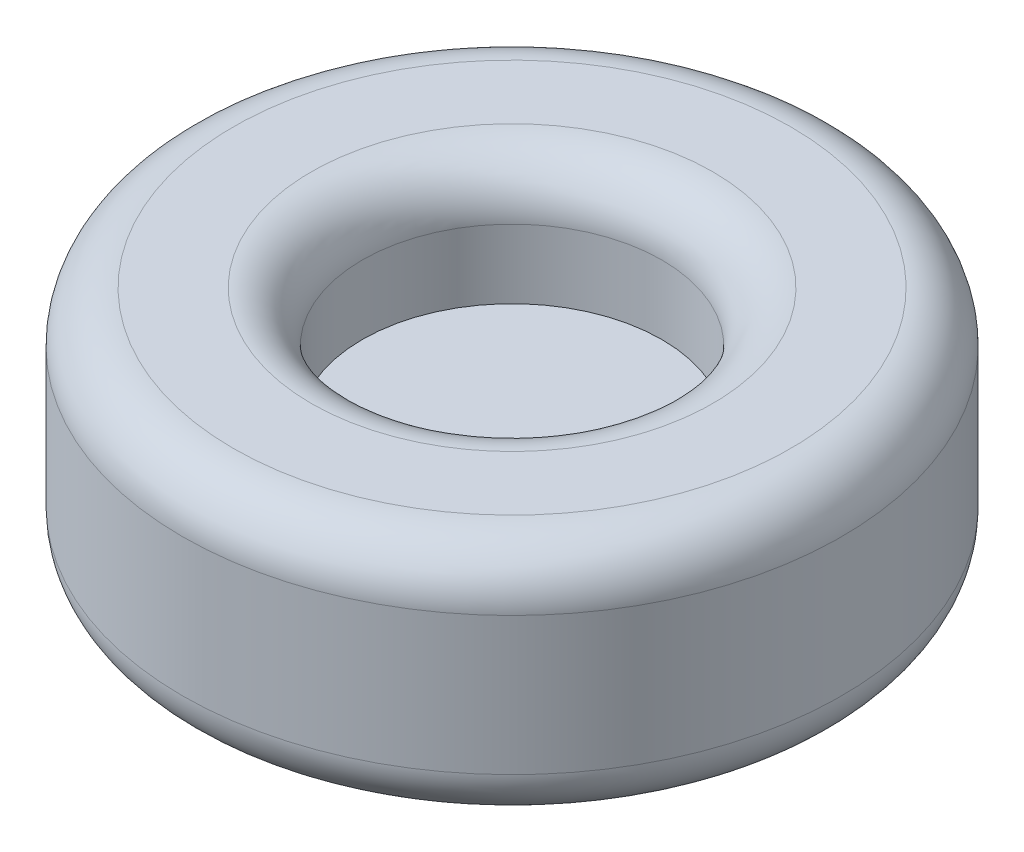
ISO-10303-21;
HEADER;
FILE_DESCRIPTION(('STEP AP214'),'2;1');
FILE_NAME('part.step','',(''),(''),'','','');
FILE_SCHEMA(('AUTOMOTIVE_DESIGN { 1 0 10303 214 1 1 1 1 }'));
ENDSEC;
DATA;
#1=APPLICATION_CONTEXT('core data for automotive mechanical design processes');
#2=APPLICATION_PROTOCOL_DEFINITION('international standard','automotive_design',2000,#1);
#3=PRODUCT_CONTEXT('',#1,'mechanical');
#4=PRODUCT('Part','Part','',(#3));
#5=PRODUCT_RELATED_PRODUCT_CATEGORY('part','',(#4));
#6=PRODUCT_DEFINITION_FORMATION('','',#4);
#7=PRODUCT_DEFINITION_CONTEXT('part definition',#1,'design');
#8=PRODUCT_DEFINITION('design','',#6,#7);
#9=PRODUCT_DEFINITION_SHAPE('','',#8);
#10=(LENGTH_UNIT() NAMED_UNIT(*) SI_UNIT(.MILLI.,.METRE.));
#11=(NAMED_UNIT(*) PLANE_ANGLE_UNIT() SI_UNIT($,.RADIAN.));
#12=(NAMED_UNIT(*) SI_UNIT($,.STERADIAN.) SOLID_ANGLE_UNIT());
#13=UNCERTAINTY_MEASURE_WITH_UNIT(LENGTH_MEASURE(1.E-05),#10,'distance_accuracy_value','');
#14=(GEOMETRIC_REPRESENTATION_CONTEXT(3) GLOBAL_UNCERTAINTY_ASSIGNED_CONTEXT((#13)) GLOBAL_UNIT_ASSIGNED_CONTEXT((#10,
#11,#12)) REPRESENTATION_CONTEXT('',''));
#15=CARTESIAN_POINT('',(0.,0.,0.));
#16=DIRECTION('',(0.,0.,1.));
#17=DIRECTION('',(1.,0.,0.));
#18=AXIS2_PLACEMENT_3D('',#15,#16,#17);
#19=CARTESIAN_POINT('',(0.,-88.9,0.));
#20=DIRECTION('',(0.,1.,0.));
#21=DIRECTION('',(0.,0.,1.));
#22=AXIS2_PLACEMENT_3D('',#19,#20,#21);
#23=CYLINDRICAL_SURFACE('',#22,279.4);
#24=CARTESIAN_POINT('',(0.,-45.72,0.));
#25=DIRECTION('',(0.,1.,0.));
#26=DIRECTION('',(0.,0.,1.));
#27=AXIS2_PLACEMENT_3D('',#24,#25,#26);
#28=CIRCLE('',#27,279.4);
#29=CARTESIAN_POINT('',(0.,-45.72,279.4));
#30=VERTEX_POINT('',#29);
#31=EDGE_CURVE('E51',#30,#30,#28,.T.);
#32=ORIENTED_EDGE('',*,*,#31,.T.);
#33=EDGE_LOOP('',(#32));
#34=FACE_BOUND('',#33,.T.);
#35=CARTESIAN_POINT('',(0.,71.12,0.));
#36=DIRECTION('',(0.,1.,0.));
#37=DIRECTION('',(0.,0.,1.));
#38=AXIS2_PLACEMENT_3D('',#35,#36,#37);
#39=CIRCLE('',#38,279.4);
#40=CARTESIAN_POINT('',(0.,71.12,279.4));
#41=VERTEX_POINT('',#40);
#42=EDGE_CURVE('E54',#41,#41,#39,.F.);
#43=ORIENTED_EDGE('',*,*,#42,.T.);
#44=EDGE_LOOP('',(#43));
#45=FACE_BOUND('',#44,.T.);
#46=ADVANCED_FACE('F31',(#34,#45),#23,.T.);
#47=CARTESIAN_POINT('',(0.,-88.9,0.));
#48=DIRECTION('',(0.,1.,0.));
#49=DIRECTION('',(0.,0.,1.));
#50=AXIS2_PLACEMENT_3D('',#47,#48,#49);
#51=PLANE('',#50);
#52=CARTESIAN_POINT('',(0.,-88.9,0.));
#53=DIRECTION('',(0.,1.,0.));
#54=DIRECTION('',(0.,0.,1.));
#55=AXIS2_PLACEMENT_3D('',#52,#53,#54);
#56=CIRCLE('',#55,236.22);
#57=CARTESIAN_POINT('',(0.,-88.9,236.22));
#58=VERTEX_POINT('',#57);
#59=EDGE_CURVE('E46',#58,#58,#56,.F.);
#60=ORIENTED_EDGE('',*,*,#59,.T.);
#61=EDGE_LOOP('',(#60));
#62=FACE_BOUND('',#61,.T.);
#63=ADVANCED_FACE('F76',(#62),#51,.F.);
#64=CARTESIAN_POINT('',(0.,114.3,0.));
#65=DIRECTION('',(0.,1.,0.));
#66=DIRECTION('',(0.,0.,1.));
#67=AXIS2_PLACEMENT_3D('',#64,#65,#66);
#68=PLANE('',#67);
#69=CARTESIAN_POINT('',(0.,114.3,0.));
#70=DIRECTION('',(0.,1.,0.));
#71=DIRECTION('',(0.,0.,1.));
#72=AXIS2_PLACEMENT_3D('',#69,#70,#71);
#73=CIRCLE('',#72,170.18);
#74=CARTESIAN_POINT('',(0.,114.3,170.18));
#75=VERTEX_POINT('',#74);
#76=EDGE_CURVE('E10',#75,#75,#73,.F.);
#77=ORIENTED_EDGE('',*,*,#76,.T.);
#78=EDGE_LOOP('',(#77));
#79=FACE_BOUND('',#78,.T.);
#80=CARTESIAN_POINT('',(0.,114.3,0.));
#81=DIRECTION('',(0.,1.,0.));
#82=DIRECTION('',(0.,0.,1.));
#83=AXIS2_PLACEMENT_3D('',#80,#81,#82);
#84=CIRCLE('',#83,236.22);
#85=CARTESIAN_POINT('',(0.,114.3,236.22));
#86=VERTEX_POINT('',#85);
#87=EDGE_CURVE('E42',#86,#86,#84,.T.);
#88=ORIENTED_EDGE('',*,*,#87,.T.);
#89=EDGE_LOOP('',(#88));
#90=FACE_BOUND('',#89,.T.);
#91=ADVANCED_FACE('F82',(#79,#90),#68,.T.);
#92=CARTESIAN_POINT('',(0.,-45.72,0.));
#93=DIRECTION('',(0.,1.,0.));
#94=DIRECTION('',(0.,0.,1.));
#95=AXIS2_PLACEMENT_3D('',#92,#93,#94);
#96=TOROIDAL_SURFACE('',#95,236.22,43.18);
#97=ORIENTED_EDGE('',*,*,#59,.F.);
#98=EDGE_LOOP('',(#97));
#99=FACE_BOUND('',#98,.T.);
#100=ORIENTED_EDGE('',*,*,#31,.F.);
#101=EDGE_LOOP('',(#100));
#102=FACE_BOUND('',#101,.T.);
#103=ADVANCED_FACE('F72',(#99,#102),#96,.T.);
#104=CARTESIAN_POINT('',(0.,71.12,0.));
#105=DIRECTION('',(0.,1.,0.));
#106=DIRECTION('',(0.,0.,1.));
#107=AXIS2_PLACEMENT_3D('',#104,#105,#106);
#108=TOROIDAL_SURFACE('',#107,236.22,43.18);
#109=ORIENTED_EDGE('',*,*,#42,.F.);
#110=EDGE_LOOP('',(#109));
#111=FACE_BOUND('',#110,.T.);
#112=ORIENTED_EDGE('',*,*,#87,.F.);
#113=EDGE_LOOP('',(#112));
#114=FACE_BOUND('',#113,.T.);
#115=ADVANCED_FACE('F65',(#111,#114),#108,.T.);
#116=CARTESIAN_POINT('',(0.,12.7,0.));
#117=DIRECTION('',(0.,1.,0.));
#118=DIRECTION('',(0.,0.,1.));
#119=AXIS2_PLACEMENT_3D('',#116,#117,#118);
#120=CYLINDRICAL_SURFACE('',#119,127.);
#121=CARTESIAN_POINT('',(0.,71.12,0.));
#122=DIRECTION('',(0.,1.,0.));
#123=DIRECTION('',(0.,0.,1.));
#124=AXIS2_PLACEMENT_3D('',#121,#122,#123);
#125=CIRCLE('',#124,127.);
#126=CARTESIAN_POINT('',(0.,71.12,127.));
#127=VERTEX_POINT('',#126);
#128=EDGE_CURVE('E38',#127,#127,#125,.T.);
#129=ORIENTED_EDGE('',*,*,#128,.T.);
#130=EDGE_LOOP('',(#129));
#131=FACE_BOUND('',#130,.T.);
#132=CARTESIAN_POINT('',(0.,12.7,0.));
#133=DIRECTION('',(0.,1.,0.));
#134=DIRECTION('',(0.,0.,1.));
#135=AXIS2_PLACEMENT_3D('',#132,#133,#134);
#136=CIRCLE('',#135,127.);
#137=CARTESIAN_POINT('',(0.,12.7,127.));
#138=VERTEX_POINT('',#137);
#139=EDGE_CURVE('E57',#138,#138,#136,.T.);
#140=ORIENTED_EDGE('',*,*,#139,.F.);
#141=EDGE_LOOP('',(#140));
#142=FACE_BOUND('',#141,.T.);
#143=ADVANCED_FACE('F63',(#131,#142),#120,.F.);
#144=CARTESIAN_POINT('',(0.,12.7,0.));
#145=DIRECTION('',(0.,1.,0.));
#146=DIRECTION('',(0.,0.,1.));
#147=AXIS2_PLACEMENT_3D('',#144,#145,#146);
#148=PLANE('',#147);
#149=ORIENTED_EDGE('',*,*,#139,.T.);
#150=EDGE_LOOP('',(#149));
#151=FACE_BOUND('',#150,.T.);
#152=ADVANCED_FACE('F61',(#151),#148,.T.);
#153=CARTESIAN_POINT('',(0.,71.12,0.));
#154=DIRECTION('',(0.,1.,0.));
#155=DIRECTION('',(0.,0.,1.));
#156=AXIS2_PLACEMENT_3D('',#153,#154,#155);
#157=TOROIDAL_SURFACE('',#156,170.18,43.18);
#158=ORIENTED_EDGE('',*,*,#76,.F.);
#159=EDGE_LOOP('',(#158));
#160=FACE_BOUND('',#159,.T.);
#161=ORIENTED_EDGE('',*,*,#128,.F.);
#162=EDGE_LOOP('',(#161));
#163=FACE_BOUND('',#162,.T.);
#164=ADVANCED_FACE('F33',(#160,#163),#157,.T.);
#165=CLOSED_SHELL('',(#46,#63,#91,#103,#115,#143,#152,#164));
#166=MANIFOLD_SOLID_BREP('B2',#165);
#167=ADVANCED_BREP_SHAPE_REPRESENTATION('',(#18,#166),#14);
#168=SHAPE_DEFINITION_REPRESENTATION(#9,#167);
ENDSEC;
END-ISO-10303-21;
